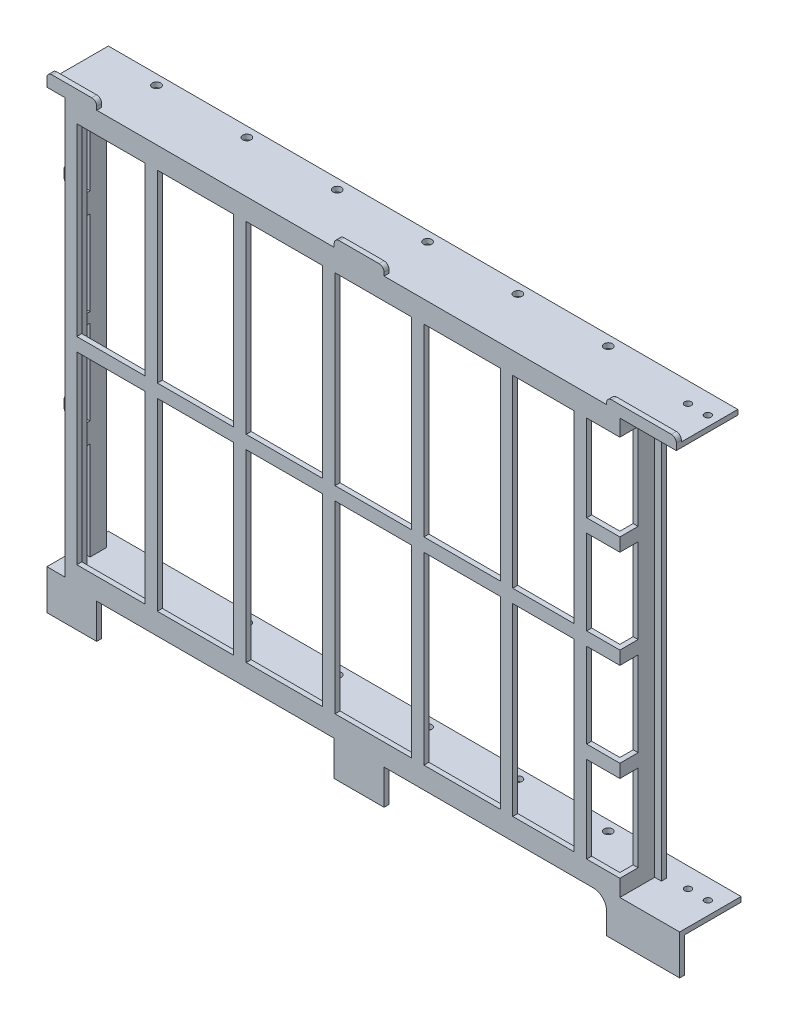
from build123d import *

# Parameters (mm, degrees)
ESQUISSE2_W             = 41
ESQUISSE2_H             = 111
ESQUISSE2_W_2           = 46
ESQUISSE2_W_3           = 37
BOSS_EXTRU_1_DEPTH      = 3
ESQUISSE3_W             = 381
ESQUISSE3_H             = 3
BOSS_EXTRU_2_DEPTH      = 34
ESQUISSE4_W             = 379
ESQUISSE4_H             = 3
BOSS_EXTRU_3_DEPTH      = 34
ESQUISSE5_W             = 3
ESQUISSE5_H             = 250
BOSS_EXTRU_4_DEPTH      = 7
ESQUISSE6_W             = 3
ESQUISSE6_H             = 10
ESQUISSE6_H_2           = 8
BOSS_EXTRU_5_DEPTH      = 8
ESQUISSE7_W             = 3
ESQUISSE7_H             = 250
BOSS_EXTRU_6_DEPTH      = 13
ESQUISSE8_W             = 3
ESQUISSE8_H             = 250
BOSS_EXTRU_7_DEPTH      = 4
BOSS_EXTRU_8_REACH      = 397.052
ESQUISSE9_W             = 5
ESQUISSE9_H             = 2.667499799
ESQUISSE10_W            = 10
ESQUISSE10_H            = 250
BOSS_EXTRU_9_DEPTH      = 3
ESQUISSE12_W            = 3
ESQUISSE12_H            = 12
ESQUISSE12_H_2          = 6
BOSS_EXTRU_10_DEPTH     = 10
ESQUISSE13_W            = 3
ESQUISSE13_H            = 12
ESQUISSE13_H_2          = 6
BOSS_EXTRU_12_DEPTH     = 3.61
ESQUISSE14_W            = 2.667499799
ESQUISSE14_H            = 12
BOSS_EXTRU_13_DEPTH     = 15
CONG_1_R                = 4
CONG_2_R                = 4
CONG_3_R                = 4
ESQUISSE15_R            = 2.5
ESQUISSE15_R_2          = 2
ENL_V_MAT_EXTRU_1_DEPTH = 387.149173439


with BuildPart() as part:
    # Esquisse2 → Boss.-Extru.1 (new body)
    with BuildSketch(Plane.XY):
        with BuildLine():
            Line((46.266128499, 187.838605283), (74.549436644, 187.838605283))
            Line((74.549436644, 187.838605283), (74.549436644, 189.838605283))
            ThreePointArc((74.549436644, 189.838605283), (75.4281163, 191.959925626), (77.549436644, 192.838605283))
            Line((77.549436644, 192.838605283), (101.549436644, 192.838605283))
            ThreePointArc((101.549436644, 192.838605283), (103.670756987, 191.959925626), (104.549436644, 189.838605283))
            Line((104.549436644, 189.838605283), (104.549436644, 187.838605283))
            Line((104.549436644, 187.838605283), (238.549436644, 187.838605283))
            Line((238.549436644, 187.838605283), (238.549436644, 188.838605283))
            ThreePointArc((238.549436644, 188.838605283), (239.4281163, 190.959925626), (241.549436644, 191.838605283))
            Line((241.549436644, 191.838605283), (277.549436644, 191.838605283))
            ThreePointArc((277.549436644, 191.838605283), (279.670756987, 190.959925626), (280.549436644, 188.838605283))
            Line((280.549436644, 188.838605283), (280.549436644, 184.838605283))
            Line((280.549436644, 184.838605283), (246.549436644, 184.838605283))
            Line((246.549436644, 184.838605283), (246.549436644, 174.838605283))
            Line((246.549436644, 174.838605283), (226.549436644, 174.838605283))
            Line((226.549436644, 174.838605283), (226.549436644, 122.838605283))
            Line((226.549436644, 122.838605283), (246.549436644, 122.838605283))
            Line((246.549436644, 122.838605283), (246.549436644, 114.838605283))
            Line((246.549436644, 114.838605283), (226.549436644, 114.838605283))
            Line((226.549436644, 114.838605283), (226.549436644, 63.838605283))
            Line((226.549436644, 63.838605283), (246.549436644, 63.838605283))
            Line((246.549436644, 63.838605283), (246.549436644, 55.838605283))
            Line((246.549436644, 55.838605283), (226.549436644, 55.838605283))
            Line((226.549436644, 55.838605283), (226.549436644, 4.838605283))
            Line((226.549436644, 4.838605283), (246.549436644, 4.838605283))
            Line((246.549436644, 4.838605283), (246.549436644, -3.161394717))
            Line((246.549436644, -3.161394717), (226.549436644, -3.161394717))
            Line((226.549436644, -3.161394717), (226.549436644, -55.161394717))
            Line((226.549436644, -55.161394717), (246.549436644, -55.161394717))
            Line((246.549436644, -55.161394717), (246.549436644, -65.161394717))
            Line((246.549436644, -65.161394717), (282.549436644, -65.161394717))
            Line((282.549436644, -65.161394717), (282.549436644, -89.161394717))
            Line((282.549436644, -89.161394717), (238.549436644, -89.161394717))
            Line((238.549436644, -89.161394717), (238.549436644, -76.161394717))
            ThreePointArc((238.549436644, -76.161394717), (236.206290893, -70.504540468), (230.549436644, -68.161394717))
            Line((230.549436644, -68.161394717), (104.549436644, -68.161394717))
            Line((104.549436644, -68.161394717), (104.549436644, -89.161394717))
            Line((104.549436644, -89.161394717), (74.549436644, -89.161394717))
            Line((74.549436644, -89.161394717), (74.549436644, -68.161394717))
            Line((74.549436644, -68.161394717), (-68.450563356, -68.161394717))
            Line((-68.450563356, -68.161394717), (-68.450563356, -89.161394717))
            Line((-68.450563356, -89.161394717), (-98.450563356, -89.161394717))
            Line((-98.450563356, -89.161394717), (-98.450563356, -65.161394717))
            Line((-98.450563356, -65.161394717), (-87.450563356, -65.161394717))
            Line((-87.450563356, -65.161394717), (-87.450563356, 184.838605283))
            Line((-87.450563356, 184.838605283), (-98.450563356, 184.838605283))
            Line((-98.450563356, 184.838605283), (-98.450563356, 189.838605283))
            ThreePointArc((-98.450563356, 189.838605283), (-97.5718837, 191.959925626), (-95.450563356, 192.838605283))
            Line((-95.450563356, 192.838605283), (-71.450563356, 192.838605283))
            ThreePointArc((-71.450563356, 192.838605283), (-69.329243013, 191.959925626), (-68.450563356, 189.838605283))
            Line((-68.450563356, 189.838605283), (-68.450563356, 187.838605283))
            Line((-68.450563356, 187.838605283), (46.266128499, 187.838605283))
        make_face()
        with Locations((-59.950563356, 0.338605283)):
            Rectangle(ESQUISSE2_W, ESQUISSE2_H, mode=Mode.SUBTRACT)
        with Locations((98.049436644, 0.338605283)):
            Rectangle(ESQUISSE2_W_2, ESQUISSE2_H, mode=Mode.SUBTRACT)
        with Locations((-59.950563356, 119.338605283)):
            Rectangle(ESQUISSE2_W, ESQUISSE2_H, mode=Mode.SUBTRACT)
        with Locations((-8.950563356, 119.338605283)):
            Rectangle(ESQUISSE2_W_2, ESQUISSE2_H, mode=Mode.SUBTRACT)
        with Locations((200.549436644, 119.338605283)):
            Rectangle(ESQUISSE2_W_3, ESQUISSE2_H, mode=Mode.SUBTRACT)
        with Locations((200.549436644, 0.338605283)):
            Rectangle(ESQUISSE2_W_3, ESQUISSE2_H, mode=Mode.SUBTRACT)
        with Locations((44.549436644, 119.338605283)):
            Rectangle(ESQUISSE2_W_2, ESQUISSE2_H, mode=Mode.SUBTRACT)
        with Locations((98.049436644, 119.338605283)):
            Rectangle(ESQUISSE2_W_2, ESQUISSE2_H, mode=Mode.SUBTRACT)
        with Locations((-8.950563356, 0.338605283)):
            Rectangle(ESQUISSE2_W_2, ESQUISSE2_H, mode=Mode.SUBTRACT)
        with Locations((151.549436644, 119.338605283)):
            Rectangle(ESQUISSE2_W_2, ESQUISSE2_H, mode=Mode.SUBTRACT)
        with Locations((151.549436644, 0.338605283)):
            Rectangle(ESQUISSE2_W_2, ESQUISSE2_H, mode=Mode.SUBTRACT)
        with Locations((44.549436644, 0.338605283)):
            Rectangle(ESQUISSE2_W_2, ESQUISSE2_H, mode=Mode.SUBTRACT)
    extrude(amount=BOSS_EXTRU_1_DEPTH)

    # Esquisse3 → Boss.-Extru.2 (add)
    with BuildSketch(Plane(origin=(0, 0, 0), x_dir=(-1, 0, 0), z_dir=(0, 0, -1))):
        with Locations((-92.049436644, -66.661394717)):
            Rectangle(ESQUISSE3_W, ESQUISSE3_H)
    extrude(amount=BOSS_EXTRU_2_DEPTH)

    # Esquisse4 → Boss.-Extru.3 (add)
    with BuildSketch(Plane(origin=(0, 0, 0), x_dir=(-1, 0, 0), z_dir=(0, 0, -1))):
        with Locations((-91.049436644, 186.338605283)):
            Rectangle(ESQUISSE4_W, ESQUISSE4_H)
    extrude(amount=BOSS_EXTRU_3_DEPTH)

    # Esquisse5 → Boss.-Extru.4 (add)
    with BuildSketch(Plane(origin=(0, 0, 0), x_dir=(-1, 0, 0), z_dir=(0, 0, -1))):
        with Locations((85.950563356, 59.838605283)):
            Rectangle(ESQUISSE5_W, ESQUISSE5_H)
    extrude(amount=BOSS_EXTRU_4_DEPTH)

    # Esquisse6 → Boss.-Extru.5 (add)
    with BuildSketch(Plane(origin=(0, 0, 0), x_dir=(-1, 0, 0), z_dir=(0, 0, -1))):
        with Locations((-245.049436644, 179.838605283)):
            Rectangle(ESQUISSE6_W, ESQUISSE6_H)
        with Locations((-245.049436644, 118.838605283)):
            Rectangle(ESQUISSE6_W, ESQUISSE6_H_2)
        with Locations((-245.049436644, 59.838605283)):
            Rectangle(ESQUISSE6_W, ESQUISSE6_H_2)
        with Locations((-245.049436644, 0.838605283)):
            Rectangle(ESQUISSE6_W, ESQUISSE6_H_2)
        with Locations((-245.049436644, -60.161394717)):
            Rectangle(ESQUISSE6_W, ESQUISSE6_H)
    extrude(amount=BOSS_EXTRU_5_DEPTH)

    # Esquisse7 → Boss.-Extru.6 (add)
    with BuildSketch(Plane(origin=(0, 0, -8), x_dir=(-1, 0, 0), z_dir=(0, 0, -1))):
        with Locations((-245.049436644, 59.838605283)):
            Rectangle(ESQUISSE7_W, ESQUISSE7_H)
    extrude(amount=BOSS_EXTRU_6_DEPTH)

    # Esquisse8 → Boss.-Extru.7 (add)
    with BuildSketch(Plane(origin=(246.549436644, 0, 0), x_dir=(0, 0, -1), z_dir=(1, 0, 0))):
        with Locations((19.5, 59.838605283)):
            Rectangle(ESQUISSE8_W, ESQUISSE8_H)
    extrude(amount=BOSS_EXTRU_7_DEPTH)

    # Esquisse9 → Boss.-Extru.8 (add, up to next)
    with BuildSketch(Plane.XZ.offset(-184.838605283), mode=Mode.PRIVATE) as boss_extru_8_sk1:
        with Locations((-95.950563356, -23.666250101)):
            Rectangle(ESQUISSE9_W, ESQUISSE9_H)
    boss_extru_8_tool1 = extrude(boss_extru_8_sk1.sketch, amount=BOSS_EXTRU_8_REACH, mode=Mode.PRIVATE) - part.part
    add(boss_extru_8_tool1.solids().sort_by_distance((-95.950563, 184.838605, -23.66625))[0])

    # Esquisse10 → Boss.-Extru.9 (add)
    with BuildSketch(Plane(origin=(-93.450563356, 0, 0), x_dir=(0, 0, -1), z_dir=(1, 0, 0))):
        with Locations((20, 59.838605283)):
            Rectangle(ESQUISSE10_W, ESQUISSE10_H)
    extrude(amount=BOSS_EXTRU_9_DEPTH)

    # Esquisse12 → Boss.-Extru.10 (add)
    with BuildSketch(Plane.XY.offset(-15)):
        with Locations((-91.950563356, -0.161394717)):
            Rectangle(ESQUISSE12_W, ESQUISSE12_H)
        with Locations((-91.950563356, 59.838605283)):
            Rectangle(ESQUISSE12_W, ESQUISSE12_H_2)
        with Locations((-91.950563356, 119.838605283)):
            Rectangle(ESQUISSE12_W, ESQUISSE12_H)
    extrude(amount=BOSS_EXTRU_10_DEPTH)

    # Esquisse13 → Boss.-Extru.12 (add)
    with BuildSketch(Plane(origin=(-90.450563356, 0, 0), x_dir=(0, 0, -1), z_dir=(1, 0, 0))):
        with Locations((6.5, 119.838605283)):
            Rectangle(ESQUISSE13_W, ESQUISSE13_H)
        with Locations((6.5, 59.838605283)):
            Rectangle(ESQUISSE13_W, ESQUISSE13_H_2)
        with Locations((6.5, -0.161394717)):
            Rectangle(ESQUISSE13_W, ESQUISSE13_H)
    extrude(amount=BOSS_EXTRU_12_DEPTH)

    # Esquisse14 → Boss.-Extru.13 (add)
    with BuildSketch(Plane.ZY.offset(98.450563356)):
        with Locations((-23.666250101, 119.838605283)):
            Rectangle(ESQUISSE14_W, ESQUISSE14_H)
        with Locations((-23.666250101, -0.161394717)):
            Rectangle(ESQUISSE14_W, ESQUISSE14_H)
    extrude(amount=BOSS_EXTRU_13_DEPTH)

    # Cong_1
    cong_1_edges = [part.edges().sort_by_distance(p)[0] for p in [
        (-113.450563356, 125.838605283, -23.6662501),
    ]]
    fillet(cong_1_edges, radius=CONG_1_R)

    # Cong_2
    cong_2_edges = [part.edges().sort_by_distance(p)[0] for p in [
        (-113.450563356, 113.838605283, -23.6662501),
    ]]
    fillet(cong_2_edges, radius=CONG_2_R)

    # Cong_3
    cong_3_edges = [part.edges().sort_by_distance(p)[0] for p in [
        (-113.450563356, -6.161394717, -23.6662501),
        (-113.450563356, 5.838605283, -23.6662501),
    ]]
    fillet(cong_3_edges, radius=CONG_3_R)

    # Esquisse15 → Enl_v. mat.-Extru.1 (cut, through all)
    with BuildSketch(Plane.XZ.offset(68.161394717)):
        with Locations((208.549436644, -28)):
            Circle(ESQUISSE15_R)
        with Locations((154.149436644, -28)):
            Circle(ESQUISSE15_R)
        with Locations((99.749436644, -28)):
            Circle(ESQUISSE15_R)
        with Locations((45.349436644, -28)):
            Circle(ESQUISSE15_R)
        with Locations((-9.050563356, -28)):
            Circle(ESQUISSE15_R)
        with Locations((-63.450563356, -28)):
            Circle(ESQUISSE15_R)
        with Locations((274.549436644, -22)):
            Circle(ESQUISSE15_R_2)
        with Locations((262.549436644, -22)):
            Circle(ESQUISSE15_R_2)
    extrude(amount=-ENL_V_MAT_EXTRU_1_DEPTH, mode=Mode.SUBTRACT)


solid = part.part
